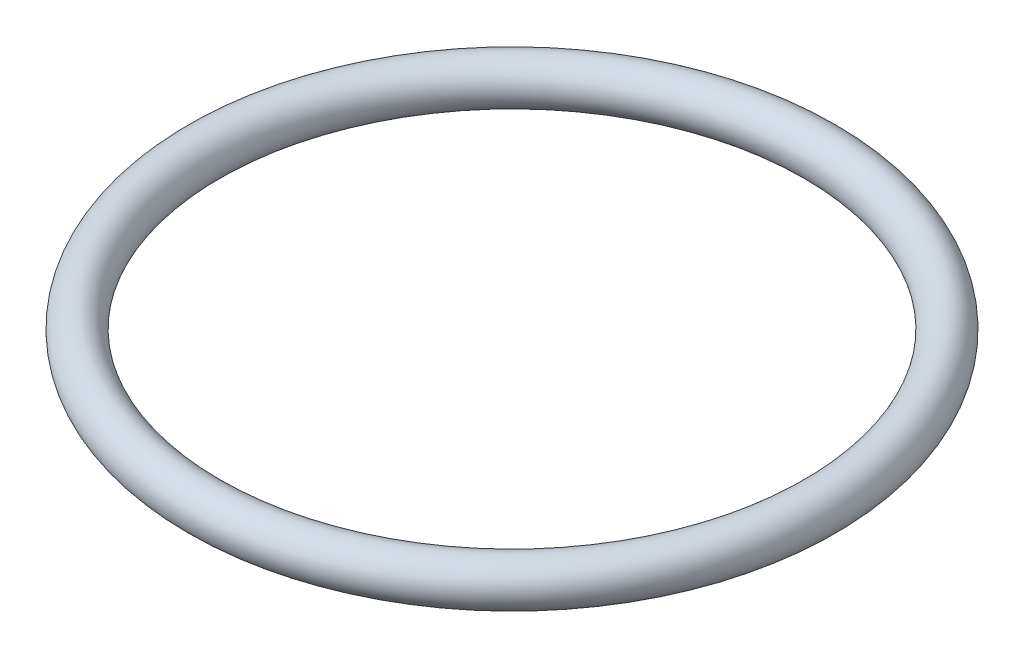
from build123d import *

# Parameters (mm, degrees)
ESQUISSE1_R = 0.5


with BuildPart() as part:
    # Esquisse1 → R_volution1 (revolve)
    with BuildSketch(Plane(origin=(0, 0, 0), x_dir=(0, 0, -1), z_dir=(1, 0, 0)), mode=Mode.PRIVATE) as r_volution1_sk:
        with Locations((7, 0.5)):
            Circle(ESQUISSE1_R)
    revolve(r_volution1_sk.sketch.rotate(Axis((0, 8.592631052, 0), (0, -1, 0)), 180), axis=Axis((0, 8.592631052, 0), (0, -1, 0)))


solid = part.part
